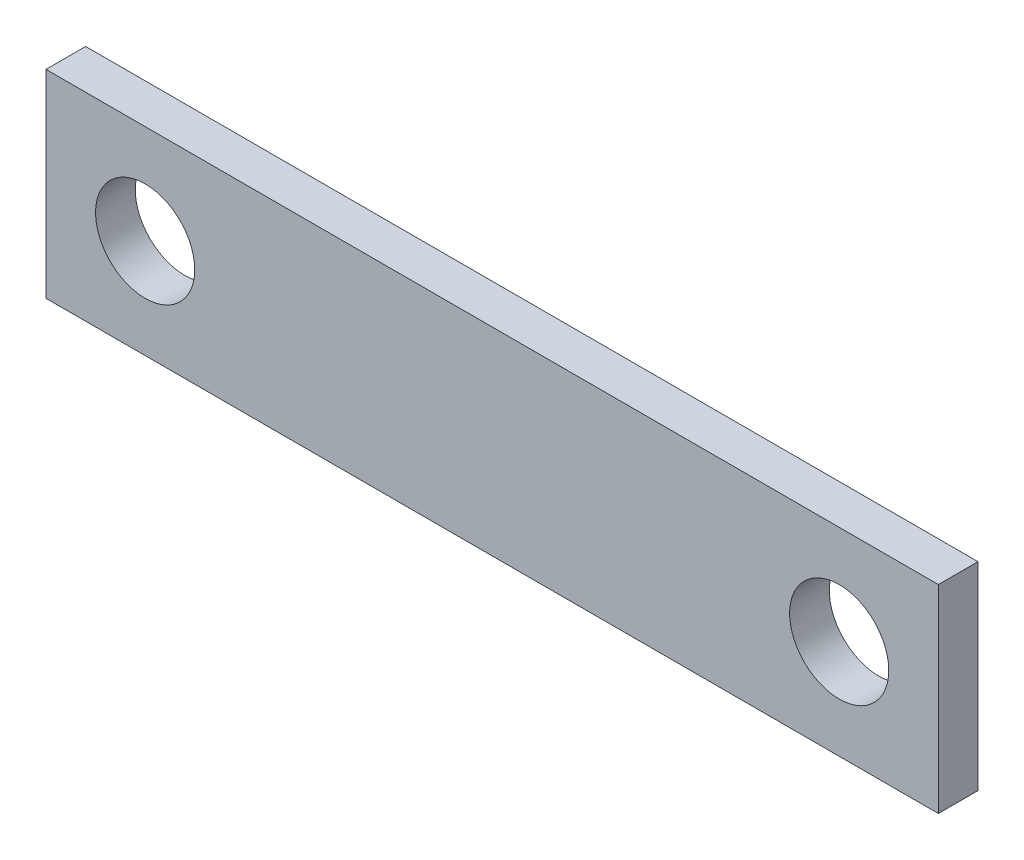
ISO-10303-21;
HEADER;
FILE_DESCRIPTION(('STEP AP214'),'2;1');
FILE_NAME('part.step','',(''),(''),'','','');
FILE_SCHEMA(('AUTOMOTIVE_DESIGN { 1 0 10303 214 1 1 1 1 }'));
ENDSEC;
DATA;
#1=APPLICATION_CONTEXT('core data for automotive mechanical design processes');
#2=APPLICATION_PROTOCOL_DEFINITION('international standard','automotive_design',2000,#1);
#3=PRODUCT_CONTEXT('',#1,'mechanical');
#4=PRODUCT('Part','Part','',(#3));
#5=PRODUCT_RELATED_PRODUCT_CATEGORY('part','',(#4));
#6=PRODUCT_DEFINITION_FORMATION('','',#4);
#7=PRODUCT_DEFINITION_CONTEXT('part definition',#1,'design');
#8=PRODUCT_DEFINITION('design','',#6,#7);
#9=PRODUCT_DEFINITION_SHAPE('','',#8);
#10=(LENGTH_UNIT() NAMED_UNIT(*) SI_UNIT(.MILLI.,.METRE.));
#11=(NAMED_UNIT(*) PLANE_ANGLE_UNIT() SI_UNIT($,.RADIAN.));
#12=(NAMED_UNIT(*) SI_UNIT($,.STERADIAN.) SOLID_ANGLE_UNIT());
#13=UNCERTAINTY_MEASURE_WITH_UNIT(LENGTH_MEASURE(1.E-05),#10,'distance_accuracy_value','');
#14=(GEOMETRIC_REPRESENTATION_CONTEXT(3) GLOBAL_UNCERTAINTY_ASSIGNED_CONTEXT((#13)) GLOBAL_UNIT_ASSIGNED_CONTEXT((#10,
#11,#12)) REPRESENTATION_CONTEXT('',''));
#15=CARTESIAN_POINT('',(0.,0.,0.));
#16=DIRECTION('',(0.,0.,1.));
#17=DIRECTION('',(1.,0.,0.));
#18=AXIS2_PLACEMENT_3D('',#15,#16,#17);
#19=CARTESIAN_POINT('',(0.,40.,8.));
#20=DIRECTION('',(0.,0.,-1.));
#21=DIRECTION('',(-1.,0.,0.));
#22=AXIS2_PLACEMENT_3D('',#19,#20,#21);
#23=PLANE('',#22);
#24=CARTESIAN_POINT('',(20.,20.,8.));
#25=DIRECTION('',(0.,0.,1.));
#26=DIRECTION('',(1.,0.,0.));
#27=AXIS2_PLACEMENT_3D('',#24,#25,#26);
#28=CIRCLE('',#27,10.);
#29=CARTESIAN_POINT('',(30.,20.,8.));
#30=VERTEX_POINT('',#29);
#31=EDGE_CURVE('E99',#30,#30,#28,.T.);
#32=ORIENTED_EDGE('',*,*,#31,.F.);
#33=EDGE_LOOP('',(#32));
#34=FACE_BOUND('',#33,.T.);
#35=DIRECTION('',(0.,-1.,0.));
#36=VECTOR('',#35,1.);
#37=CARTESIAN_POINT('',(0.,0.,8.));
#38=LINE('',#37,#36);
#39=CARTESIAN_POINT('',(0.,40.,8.));
#40=VERTEX_POINT('',#39);
#41=CARTESIAN_POINT('',(0.,0.,8.));
#42=VERTEX_POINT('',#41);
#43=EDGE_CURVE('E84',#40,#42,#38,.T.);
#44=ORIENTED_EDGE('',*,*,#43,.T.);
#45=DIRECTION('',(1.,0.,0.));
#46=VECTOR('',#45,1.);
#47=CARTESIAN_POINT('',(0.,0.,8.));
#48=LINE('',#47,#46);
#49=CARTESIAN_POINT('',(180.,0.,8.));
#50=VERTEX_POINT('',#49);
#51=EDGE_CURVE('E79',#42,#50,#48,.T.);
#52=ORIENTED_EDGE('',*,*,#51,.T.);
#53=DIRECTION('',(0.,1.,0.));
#54=VECTOR('',#53,1.);
#55=CARTESIAN_POINT('',(180.,0.,8.));
#56=LINE('',#55,#54);
#57=CARTESIAN_POINT('',(180.,40.,8.));
#58=VERTEX_POINT('',#57);
#59=EDGE_CURVE('E82',#50,#58,#56,.T.);
#60=ORIENTED_EDGE('',*,*,#59,.T.);
#61=DIRECTION('',(-1.,0.,0.));
#62=VECTOR('',#61,1.);
#63=CARTESIAN_POINT('',(0.,40.,8.));
#64=LINE('',#63,#62);
#65=EDGE_CURVE('E49',#58,#40,#64,.T.);
#66=ORIENTED_EDGE('',*,*,#65,.T.);
#67=EDGE_LOOP('',(#44,#52,#60,#66));
#68=FACE_BOUND('',#67,.T.);
#69=CARTESIAN_POINT('',(160.,20.,8.));
#70=DIRECTION('',(0.,0.,1.));
#71=DIRECTION('',(1.,0.,0.));
#72=AXIS2_PLACEMENT_3D('',#69,#70,#71);
#73=CIRCLE('',#72,10.);
#74=CARTESIAN_POINT('',(170.,20.,8.));
#75=VERTEX_POINT('',#74);
#76=EDGE_CURVE('E114',#75,#75,#73,.T.);
#77=ORIENTED_EDGE('',*,*,#76,.F.);
#78=EDGE_LOOP('',(#77));
#79=FACE_BOUND('',#78,.T.);
#80=ADVANCED_FACE('F32',(#34,#68,#79),#23,.F.);
#81=CARTESIAN_POINT('',(0.,40.,0.));
#82=DIRECTION('',(0.,0.,-1.));
#83=DIRECTION('',(-1.,0.,0.));
#84=AXIS2_PLACEMENT_3D('',#81,#82,#83);
#85=PLANE('',#84);
#86=CARTESIAN_POINT('',(20.,20.,0.));
#87=DIRECTION('',(0.,0.,1.));
#88=DIRECTION('',(1.,0.,0.));
#89=AXIS2_PLACEMENT_3D('',#86,#87,#88);
#90=CIRCLE('',#89,10.);
#91=CARTESIAN_POINT('',(30.,20.,0.));
#92=VERTEX_POINT('',#91);
#93=EDGE_CURVE('E111',#92,#92,#90,.T.);
#94=ORIENTED_EDGE('',*,*,#93,.T.);
#95=EDGE_LOOP('',(#94));
#96=FACE_BOUND('',#95,.T.);
#97=DIRECTION('',(0.,-1.,0.));
#98=VECTOR('',#97,1.);
#99=CARTESIAN_POINT('',(0.,0.,0.));
#100=LINE('',#99,#98);
#101=CARTESIAN_POINT('',(0.,40.,0.));
#102=VERTEX_POINT('',#101);
#103=CARTESIAN_POINT('',(0.,0.,0.));
#104=VERTEX_POINT('',#103);
#105=EDGE_CURVE('E96',#102,#104,#100,.T.);
#106=ORIENTED_EDGE('',*,*,#105,.F.);
#107=DIRECTION('',(-1.,0.,0.));
#108=VECTOR('',#107,1.);
#109=CARTESIAN_POINT('',(0.,40.,0.));
#110=LINE('',#109,#108);
#111=CARTESIAN_POINT('',(180.,40.,0.));
#112=VERTEX_POINT('',#111);
#113=EDGE_CURVE('E72',#112,#102,#110,.T.);
#114=ORIENTED_EDGE('',*,*,#113,.F.);
#115=DIRECTION('',(0.,1.,0.));
#116=VECTOR('',#115,1.);
#117=CARTESIAN_POINT('',(180.,0.,0.));
#118=LINE('',#117,#116);
#119=CARTESIAN_POINT('',(180.,0.,0.));
#120=VERTEX_POINT('',#119);
#121=EDGE_CURVE('E66',#120,#112,#118,.T.);
#122=ORIENTED_EDGE('',*,*,#121,.F.);
#123=DIRECTION('',(1.,0.,0.));
#124=VECTOR('',#123,1.);
#125=CARTESIAN_POINT('',(0.,0.,0.));
#126=LINE('',#125,#124);
#127=EDGE_CURVE('E88',#104,#120,#126,.T.);
#128=ORIENTED_EDGE('',*,*,#127,.F.);
#129=EDGE_LOOP('',(#106,#114,#122,#128));
#130=FACE_BOUND('',#129,.T.);
#131=CARTESIAN_POINT('',(160.,20.,0.));
#132=DIRECTION('',(0.,0.,1.));
#133=DIRECTION('',(1.,0.,0.));
#134=AXIS2_PLACEMENT_3D('',#131,#132,#133);
#135=CIRCLE('',#134,10.);
#136=CARTESIAN_POINT('',(170.,20.,0.));
#137=VERTEX_POINT('',#136);
#138=EDGE_CURVE('E117',#137,#137,#135,.T.);
#139=ORIENTED_EDGE('',*,*,#138,.T.);
#140=EDGE_LOOP('',(#139));
#141=FACE_BOUND('',#140,.T.);
#142=ADVANCED_FACE('F107',(#96,#130,#141),#85,.T.);
#143=CARTESIAN_POINT('',(0.,0.,8.));
#144=DIRECTION('',(1.,0.,0.));
#145=DIRECTION('',(0.,0.,-1.));
#146=AXIS2_PLACEMENT_3D('',#143,#144,#145);
#147=PLANE('',#146);
#148=ORIENTED_EDGE('',*,*,#105,.T.);
#149=DIRECTION('',(0.,0.,-1.));
#150=VECTOR('',#149,1.);
#151=CARTESIAN_POINT('',(0.,0.,8.));
#152=LINE('',#151,#150);
#153=EDGE_CURVE('E11',#42,#104,#152,.T.);
#154=ORIENTED_EDGE('',*,*,#153,.F.);
#155=ORIENTED_EDGE('',*,*,#43,.F.);
#156=DIRECTION('',(0.,0.,-1.));
#157=VECTOR('',#156,1.);
#158=CARTESIAN_POINT('',(0.,40.,8.));
#159=LINE('',#158,#157);
#160=EDGE_CURVE('E92',#40,#102,#159,.T.);
#161=ORIENTED_EDGE('',*,*,#160,.T.);
#162=EDGE_LOOP('',(#148,#154,#155,#161));
#163=FACE_BOUND('',#162,.T.);
#164=ADVANCED_FACE('F34',(#163),#147,.F.);
#165=CARTESIAN_POINT('',(0.,0.,8.));
#166=DIRECTION('',(0.,1.,0.));
#167=DIRECTION('',(0.,0.,1.));
#168=AXIS2_PLACEMENT_3D('',#165,#166,#167);
#169=PLANE('',#168);
#170=ORIENTED_EDGE('',*,*,#127,.T.);
#171=DIRECTION('',(0.,0.,-1.));
#172=VECTOR('',#171,1.);
#173=CARTESIAN_POINT('',(180.,0.,8.));
#174=LINE('',#173,#172);
#175=EDGE_CURVE('E41',#50,#120,#174,.T.);
#176=ORIENTED_EDGE('',*,*,#175,.F.);
#177=ORIENTED_EDGE('',*,*,#51,.F.);
#178=ORIENTED_EDGE('',*,*,#153,.T.);
#179=EDGE_LOOP('',(#170,#176,#177,#178));
#180=FACE_BOUND('',#179,.T.);
#181=ADVANCED_FACE('F87',(#180),#169,.F.);
#182=CARTESIAN_POINT('',(180.,0.,8.));
#183=DIRECTION('',(-1.,0.,0.));
#184=DIRECTION('',(0.,0.,1.));
#185=AXIS2_PLACEMENT_3D('',#182,#183,#184);
#186=PLANE('',#185);
#187=ORIENTED_EDGE('',*,*,#121,.T.);
#188=DIRECTION('',(0.,0.,-1.));
#189=VECTOR('',#188,1.);
#190=CARTESIAN_POINT('',(180.,40.,8.));
#191=LINE('',#190,#189);
#192=EDGE_CURVE('E89',#58,#112,#191,.T.);
#193=ORIENTED_EDGE('',*,*,#192,.F.);
#194=ORIENTED_EDGE('',*,*,#59,.F.);
#195=ORIENTED_EDGE('',*,*,#175,.T.);
#196=EDGE_LOOP('',(#187,#193,#194,#195));
#197=FACE_BOUND('',#196,.T.);
#198=ADVANCED_FACE('F90',(#197),#186,.F.);
#199=CARTESIAN_POINT('',(0.,40.,8.));
#200=DIRECTION('',(0.,-1.,0.));
#201=DIRECTION('',(0.,0.,-1.));
#202=AXIS2_PLACEMENT_3D('',#199,#200,#201);
#203=PLANE('',#202);
#204=ORIENTED_EDGE('',*,*,#113,.T.);
#205=ORIENTED_EDGE('',*,*,#160,.F.);
#206=ORIENTED_EDGE('',*,*,#65,.F.);
#207=ORIENTED_EDGE('',*,*,#192,.T.);
#208=EDGE_LOOP('',(#204,#205,#206,#207));
#209=FACE_BOUND('',#208,.T.);
#210=ADVANCED_FACE('F104',(#209),#203,.F.);
#211=CARTESIAN_POINT('',(20.,20.,8.));
#212=DIRECTION('',(0.,0.,-1.));
#213=DIRECTION('',(-1.,0.,0.));
#214=AXIS2_PLACEMENT_3D('',#211,#212,#213);
#215=CYLINDRICAL_SURFACE('',#214,10.);
#216=ORIENTED_EDGE('',*,*,#31,.T.);
#217=EDGE_LOOP('',(#216));
#218=FACE_BOUND('',#217,.T.);
#219=ORIENTED_EDGE('',*,*,#93,.F.);
#220=EDGE_LOOP('',(#219));
#221=FACE_BOUND('',#220,.T.);
#222=ADVANCED_FACE('F135',(#218,#221),#215,.F.);
#223=CARTESIAN_POINT('',(160.,20.,8.));
#224=DIRECTION('',(0.,0.,-1.));
#225=DIRECTION('',(-1.,0.,0.));
#226=AXIS2_PLACEMENT_3D('',#223,#224,#225);
#227=CYLINDRICAL_SURFACE('',#226,10.);
#228=ORIENTED_EDGE('',*,*,#76,.T.);
#229=EDGE_LOOP('',(#228));
#230=FACE_BOUND('',#229,.T.);
#231=ORIENTED_EDGE('',*,*,#138,.F.);
#232=EDGE_LOOP('',(#231));
#233=FACE_BOUND('',#232,.T.);
#234=ADVANCED_FACE('F123',(#230,#233),#227,.F.);
#235=CLOSED_SHELL('',(#80,#142,#164,#181,#198,#210,#222,#234));
#236=MANIFOLD_SOLID_BREP('B2',#235);
#237=ADVANCED_BREP_SHAPE_REPRESENTATION('',(#18,#236),#14);
#238=SHAPE_DEFINITION_REPRESENTATION(#9,#237);
ENDSEC;
END-ISO-10303-21;
